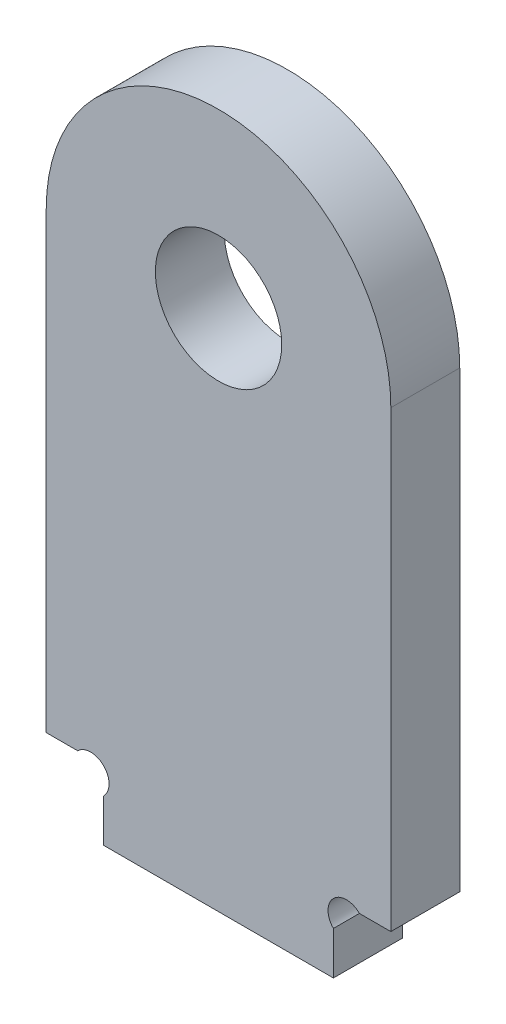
ISO-10303-21;
HEADER;
FILE_DESCRIPTION(('STEP AP214'),'2;1');
FILE_NAME('part.step','',(''),(''),'','','');
FILE_SCHEMA(('AUTOMOTIVE_DESIGN { 1 0 10303 214 1 1 1 1 }'));
ENDSEC;
DATA;
#1=APPLICATION_CONTEXT('core data for automotive mechanical design processes');
#2=APPLICATION_PROTOCOL_DEFINITION('international standard','automotive_design',2000,#1);
#3=PRODUCT_CONTEXT('',#1,'mechanical');
#4=PRODUCT('Part','Part','',(#3));
#5=PRODUCT_RELATED_PRODUCT_CATEGORY('part','',(#4));
#6=PRODUCT_DEFINITION_FORMATION('','',#4);
#7=PRODUCT_DEFINITION_CONTEXT('part definition',#1,'design');
#8=PRODUCT_DEFINITION('design','',#6,#7);
#9=PRODUCT_DEFINITION_SHAPE('','',#8);
#10=(LENGTH_UNIT() NAMED_UNIT(*) SI_UNIT(.MILLI.,.METRE.));
#11=(NAMED_UNIT(*) PLANE_ANGLE_UNIT() SI_UNIT($,.RADIAN.));
#12=(NAMED_UNIT(*) SI_UNIT($,.STERADIAN.) SOLID_ANGLE_UNIT());
#13=UNCERTAINTY_MEASURE_WITH_UNIT(LENGTH_MEASURE(1.E-05),#10,'distance_accuracy_value','');
#14=(GEOMETRIC_REPRESENTATION_CONTEXT(3) GLOBAL_UNCERTAINTY_ASSIGNED_CONTEXT((#13)) GLOBAL_UNIT_ASSIGNED_CONTEXT((#10,
#11,#12)) REPRESENTATION_CONTEXT('',''));
#15=CARTESIAN_POINT('',(0.,0.,0.));
#16=DIRECTION('',(0.,0.,1.));
#17=DIRECTION('',(1.,0.,0.));
#18=AXIS2_PLACEMENT_3D('',#15,#16,#17);
#19=CARTESIAN_POINT('',(15.,39.5,6.));
#20=DIRECTION('',(0.,0.,-1.));
#21=DIRECTION('',(-1.,0.,0.));
#22=AXIS2_PLACEMENT_3D('',#19,#20,#21);
#23=PLANE('',#22);
#24=CARTESIAN_POINT('',(15.,39.5,6.));
#25=DIRECTION('',(0.,0.,1.));
#26=DIRECTION('',(-1.,0.,0.));
#27=AXIS2_PLACEMENT_3D('',#24,#25,#26);
#28=CIRCLE('',#27,15.);
#29=CARTESIAN_POINT('',(30.,39.5,6.));
#30=VERTEX_POINT('',#29);
#31=CARTESIAN_POINT('',(0.,39.5,6.));
#32=VERTEX_POINT('',#31);
#33=EDGE_CURVE('E144',#30,#32,#28,.T.);
#34=ORIENTED_EDGE('',*,*,#33,.T.);
#35=DIRECTION('',(0.,-1.,0.));
#36=VECTOR('',#35,1.);
#37=CARTESIAN_POINT('',(0.,39.5,6.));
#38=LINE('',#37,#36);
#39=CARTESIAN_POINT('',(0.,0.,6.));
#40=VERTEX_POINT('',#39);
#41=EDGE_CURVE('E117',#32,#40,#38,.T.);
#42=ORIENTED_EDGE('',*,*,#41,.T.);
#43=DIRECTION('',(1.,0.,0.));
#44=VECTOR('',#43,1.);
#45=CARTESIAN_POINT('',(0.,0.,6.));
#46=LINE('',#45,#44);
#47=CARTESIAN_POINT('',(2.73725830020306,0.,6.));
#48=VERTEX_POINT('',#47);
#49=EDGE_CURVE('E147',#40,#48,#46,.T.);
#50=ORIENTED_EDGE('',*,*,#49,.T.);
#51=CARTESIAN_POINT('',(3.86862915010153,-1.13137084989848,6.));
#52=DIRECTION('',(0.,0.,-1.));
#53=DIRECTION('',(1.,0.,0.));
#54=AXIS2_PLACEMENT_3D('',#51,#52,#53);
#55=CIRCLE('',#54,1.6);
#56=CARTESIAN_POINT('',(5.,-2.26274169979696,6.));
#57=VERTEX_POINT('',#56);
#58=EDGE_CURVE('E149',#48,#57,#55,.T.);
#59=ORIENTED_EDGE('',*,*,#58,.T.);
#60=DIRECTION('',(0.,-1.,0.));
#61=VECTOR('',#60,1.);
#62=CARTESIAN_POINT('',(5.,-2.26274169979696,6.));
#63=LINE('',#62,#61);
#64=CARTESIAN_POINT('',(5.,-6.,6.));
#65=VERTEX_POINT('',#64);
#66=EDGE_CURVE('E151',#57,#65,#63,.T.);
#67=ORIENTED_EDGE('',*,*,#66,.T.);
#68=DIRECTION('',(1.,0.,0.));
#69=VECTOR('',#68,1.);
#70=CARTESIAN_POINT('',(5.,-6.,6.));
#71=LINE('',#70,#69);
#72=CARTESIAN_POINT('',(25.,-6.,6.));
#73=VERTEX_POINT('',#72);
#74=EDGE_CURVE('E153',#65,#73,#71,.T.);
#75=ORIENTED_EDGE('',*,*,#74,.T.);
#76=DIRECTION('',(0.,1.,0.));
#77=VECTOR('',#76,1.);
#78=CARTESIAN_POINT('',(25.,-6.,6.));
#79=LINE('',#78,#77);
#80=CARTESIAN_POINT('',(25.,-2.26274169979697,6.));
#81=VERTEX_POINT('',#80);
#82=EDGE_CURVE('E155',#73,#81,#79,.T.);
#83=ORIENTED_EDGE('',*,*,#82,.T.);
#84=CARTESIAN_POINT('',(26.1313708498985,-1.13137084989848,6.));
#85=DIRECTION('',(0.,0.,-1.));
#86=DIRECTION('',(-1.,0.,0.));
#87=AXIS2_PLACEMENT_3D('',#84,#85,#86);
#88=CIRCLE('',#87,1.6);
#89=CARTESIAN_POINT('',(27.262741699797,0.,6.));
#90=VERTEX_POINT('',#89);
#91=EDGE_CURVE('E157',#81,#90,#88,.T.);
#92=ORIENTED_EDGE('',*,*,#91,.T.);
#93=DIRECTION('',(1.,0.,0.));
#94=VECTOR('',#93,1.);
#95=CARTESIAN_POINT('',(27.262741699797,0.,6.));
#96=LINE('',#95,#94);
#97=CARTESIAN_POINT('',(30.,0.,6.));
#98=VERTEX_POINT('',#97);
#99=EDGE_CURVE('E46',#90,#98,#96,.T.);
#100=ORIENTED_EDGE('',*,*,#99,.T.);
#101=DIRECTION('',(0.,1.,0.));
#102=VECTOR('',#101,1.);
#103=CARTESIAN_POINT('',(30.,0.,6.));
#104=LINE('',#103,#102);
#105=EDGE_CURVE('E41',#98,#30,#104,.T.);
#106=ORIENTED_EDGE('',*,*,#105,.T.);
#107=EDGE_LOOP('',(#34,#42,#50,#59,#67,#75,#83,#92,#100,#106));
#108=FACE_BOUND('',#107,.T.);
#109=CARTESIAN_POINT('',(15.,39.5,6.));
#110=DIRECTION('',(0.,0.,1.));
#111=DIRECTION('',(1.,0.,0.));
#112=AXIS2_PLACEMENT_3D('',#109,#110,#111);
#113=CIRCLE('',#112,5.5);
#114=CARTESIAN_POINT('',(20.5,39.5,6.));
#115=VERTEX_POINT('',#114);
#116=EDGE_CURVE('E122',#115,#115,#113,.T.);
#117=ORIENTED_EDGE('',*,*,#116,.F.);
#118=EDGE_LOOP('',(#117));
#119=FACE_BOUND('',#118,.T.);
#120=ADVANCED_FACE('F26',(#108,#119),#23,.F.);
#121=CARTESIAN_POINT('',(15.,39.5,0.));
#122=DIRECTION('',(0.,0.,-1.));
#123=DIRECTION('',(-1.,0.,0.));
#124=AXIS2_PLACEMENT_3D('',#121,#122,#123);
#125=PLANE('',#124);
#126=CARTESIAN_POINT('',(15.,39.5,0.));
#127=DIRECTION('',(0.,0.,1.));
#128=DIRECTION('',(-1.,0.,0.));
#129=AXIS2_PLACEMENT_3D('',#126,#127,#128);
#130=CIRCLE('',#129,15.);
#131=CARTESIAN_POINT('',(30.,39.5,0.));
#132=VERTEX_POINT('',#131);
#133=CARTESIAN_POINT('',(0.,39.5,0.));
#134=VERTEX_POINT('',#133);
#135=EDGE_CURVE('E108',#132,#134,#130,.T.);
#136=ORIENTED_EDGE('',*,*,#135,.F.);
#137=DIRECTION('',(0.,1.,0.));
#138=VECTOR('',#137,1.);
#139=CARTESIAN_POINT('',(30.,0.,0.));
#140=LINE('',#139,#138);
#141=CARTESIAN_POINT('',(30.,0.,0.));
#142=VERTEX_POINT('',#141);
#143=EDGE_CURVE('E142',#142,#132,#140,.T.);
#144=ORIENTED_EDGE('',*,*,#143,.F.);
#145=DIRECTION('',(1.,0.,0.));
#146=VECTOR('',#145,1.);
#147=CARTESIAN_POINT('',(27.262741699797,0.,0.));
#148=LINE('',#147,#146);
#149=CARTESIAN_POINT('',(27.262741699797,0.,0.));
#150=VERTEX_POINT('',#149);
#151=EDGE_CURVE('E140',#150,#142,#148,.T.);
#152=ORIENTED_EDGE('',*,*,#151,.F.);
#153=CARTESIAN_POINT('',(26.1313708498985,-1.13137084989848,0.));
#154=DIRECTION('',(0.,0.,-1.));
#155=DIRECTION('',(-1.,0.,0.));
#156=AXIS2_PLACEMENT_3D('',#153,#154,#155);
#157=CIRCLE('',#156,1.6);
#158=CARTESIAN_POINT('',(25.,-2.26274169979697,0.));
#159=VERTEX_POINT('',#158);
#160=EDGE_CURVE('E138',#159,#150,#157,.T.);
#161=ORIENTED_EDGE('',*,*,#160,.F.);
#162=DIRECTION('',(0.,1.,0.));
#163=VECTOR('',#162,1.);
#164=CARTESIAN_POINT('',(25.,-6.,0.));
#165=LINE('',#164,#163);
#166=CARTESIAN_POINT('',(25.,-6.,0.));
#167=VERTEX_POINT('',#166);
#168=EDGE_CURVE('E136',#167,#159,#165,.T.);
#169=ORIENTED_EDGE('',*,*,#168,.F.);
#170=DIRECTION('',(1.,0.,0.));
#171=VECTOR('',#170,1.);
#172=CARTESIAN_POINT('',(5.,-6.,0.));
#173=LINE('',#172,#171);
#174=CARTESIAN_POINT('',(5.,-6.,0.));
#175=VERTEX_POINT('',#174);
#176=EDGE_CURVE('E134',#175,#167,#173,.T.);
#177=ORIENTED_EDGE('',*,*,#176,.F.);
#178=DIRECTION('',(0.,-1.,0.));
#179=VECTOR('',#178,1.);
#180=CARTESIAN_POINT('',(5.,-2.26274169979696,0.));
#181=LINE('',#180,#179);
#182=CARTESIAN_POINT('',(5.,-2.26274169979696,0.));
#183=VERTEX_POINT('',#182);
#184=EDGE_CURVE('E132',#183,#175,#181,.T.);
#185=ORIENTED_EDGE('',*,*,#184,.F.);
#186=CARTESIAN_POINT('',(3.86862915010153,-1.13137084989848,0.));
#187=DIRECTION('',(0.,0.,-1.));
#188=DIRECTION('',(1.,0.,0.));
#189=AXIS2_PLACEMENT_3D('',#186,#187,#188);
#190=CIRCLE('',#189,1.6);
#191=CARTESIAN_POINT('',(2.73725830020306,0.,0.));
#192=VERTEX_POINT('',#191);
#193=EDGE_CURVE('E130',#192,#183,#190,.T.);
#194=ORIENTED_EDGE('',*,*,#193,.F.);
#195=DIRECTION('',(1.,0.,0.));
#196=VECTOR('',#195,1.);
#197=CARTESIAN_POINT('',(0.,0.,0.));
#198=LINE('',#197,#196);
#199=CARTESIAN_POINT('',(0.,0.,0.));
#200=VERTEX_POINT('',#199);
#201=EDGE_CURVE('E110',#200,#192,#198,.T.);
#202=ORIENTED_EDGE('',*,*,#201,.F.);
#203=DIRECTION('',(0.,-1.,0.));
#204=VECTOR('',#203,1.);
#205=CARTESIAN_POINT('',(0.,39.5,0.));
#206=LINE('',#205,#204);
#207=EDGE_CURVE('E103',#134,#200,#206,.T.);
#208=ORIENTED_EDGE('',*,*,#207,.F.);
#209=EDGE_LOOP('',(#136,#144,#152,#161,#169,#177,#185,#194,#202,#208));
#210=FACE_BOUND('',#209,.T.);
#211=CARTESIAN_POINT('',(15.,39.5,0.));
#212=DIRECTION('',(0.,0.,1.));
#213=DIRECTION('',(1.,0.,0.));
#214=AXIS2_PLACEMENT_3D('',#211,#212,#213);
#215=CIRCLE('',#214,5.5);
#216=CARTESIAN_POINT('',(20.5,39.5,0.));
#217=VERTEX_POINT('',#216);
#218=EDGE_CURVE('E125',#217,#217,#215,.T.);
#219=ORIENTED_EDGE('',*,*,#218,.T.);
#220=EDGE_LOOP('',(#219));
#221=FACE_BOUND('',#220,.T.);
#222=ADVANCED_FACE('F104',(#210,#221),#125,.T.);
#223=CARTESIAN_POINT('',(15.,39.5,6.));
#224=DIRECTION('',(0.,0.,-1.));
#225=DIRECTION('',(-1.,0.,0.));
#226=AXIS2_PLACEMENT_3D('',#223,#224,#225);
#227=CYLINDRICAL_SURFACE('',#226,15.);
#228=ORIENTED_EDGE('',*,*,#135,.T.);
#229=DIRECTION('',(0.,0.,-1.));
#230=VECTOR('',#229,1.);
#231=CARTESIAN_POINT('',(0.,39.5,6.));
#232=LINE('',#231,#230);
#233=EDGE_CURVE('E11',#32,#134,#232,.T.);
#234=ORIENTED_EDGE('',*,*,#233,.F.);
#235=ORIENTED_EDGE('',*,*,#33,.F.);
#236=DIRECTION('',(0.,0.,-1.));
#237=VECTOR('',#236,1.);
#238=CARTESIAN_POINT('',(30.,39.5,6.));
#239=LINE('',#238,#237);
#240=EDGE_CURVE('E121',#30,#132,#239,.T.);
#241=ORIENTED_EDGE('',*,*,#240,.T.);
#242=EDGE_LOOP('',(#228,#234,#235,#241));
#243=FACE_BOUND('',#242,.T.);
#244=ADVANCED_FACE('F28',(#243),#227,.T.);
#245=CARTESIAN_POINT('',(0.,39.5,6.));
#246=DIRECTION('',(1.,0.,0.));
#247=DIRECTION('',(0.,0.,-1.));
#248=AXIS2_PLACEMENT_3D('',#245,#246,#247);
#249=PLANE('',#248);
#250=ORIENTED_EDGE('',*,*,#207,.T.);
#251=DIRECTION('',(0.,0.,-1.));
#252=VECTOR('',#251,1.);
#253=CARTESIAN_POINT('',(0.,0.,6.));
#254=LINE('',#253,#252);
#255=EDGE_CURVE('E34',#40,#200,#254,.T.);
#256=ORIENTED_EDGE('',*,*,#255,.F.);
#257=ORIENTED_EDGE('',*,*,#41,.F.);
#258=ORIENTED_EDGE('',*,*,#233,.T.);
#259=EDGE_LOOP('',(#250,#256,#257,#258));
#260=FACE_BOUND('',#259,.T.);
#261=ADVANCED_FACE('F116',(#260),#249,.F.);
#262=CARTESIAN_POINT('',(0.,0.,6.));
#263=DIRECTION('',(0.,1.,0.));
#264=DIRECTION('',(0.,0.,1.));
#265=AXIS2_PLACEMENT_3D('',#262,#263,#264);
#266=PLANE('',#265);
#267=ORIENTED_EDGE('',*,*,#201,.T.);
#268=DIRECTION('',(0.,0.,-1.));
#269=VECTOR('',#268,1.);
#270=CARTESIAN_POINT('',(2.73725830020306,0.,6.));
#271=LINE('',#270,#269);
#272=EDGE_CURVE('E180',#48,#192,#271,.T.);
#273=ORIENTED_EDGE('',*,*,#272,.F.);
#274=ORIENTED_EDGE('',*,*,#49,.F.);
#275=ORIENTED_EDGE('',*,*,#255,.T.);
#276=EDGE_LOOP('',(#267,#273,#274,#275));
#277=FACE_BOUND('',#276,.T.);
#278=ADVANCED_FACE('F184',(#277),#266,.F.);
#279=CARTESIAN_POINT('',(3.86862915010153,-1.13137084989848,6.));
#280=DIRECTION('',(0.,0.,-1.));
#281=DIRECTION('',(-1.,0.,0.));
#282=AXIS2_PLACEMENT_3D('',#279,#280,#281);
#283=CYLINDRICAL_SURFACE('',#282,1.6);
#284=ORIENTED_EDGE('',*,*,#193,.T.);
#285=DIRECTION('',(0.,0.,-1.));
#286=VECTOR('',#285,1.);
#287=CARTESIAN_POINT('',(5.,-2.26274169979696,6.));
#288=LINE('',#287,#286);
#289=EDGE_CURVE('E177',#57,#183,#288,.T.);
#290=ORIENTED_EDGE('',*,*,#289,.F.);
#291=ORIENTED_EDGE('',*,*,#58,.F.);
#292=ORIENTED_EDGE('',*,*,#272,.T.);
#293=EDGE_LOOP('',(#284,#290,#291,#292));
#294=FACE_BOUND('',#293,.T.);
#295=ADVANCED_FACE('F192',(#294),#283,.F.);
#296=CARTESIAN_POINT('',(5.,-2.26274169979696,6.));
#297=DIRECTION('',(1.,0.,0.));
#298=DIRECTION('',(0.,1.,0.));
#299=AXIS2_PLACEMENT_3D('',#296,#297,#298);
#300=PLANE('',#299);
#301=ORIENTED_EDGE('',*,*,#184,.T.);
#302=DIRECTION('',(0.,0.,-1.));
#303=VECTOR('',#302,1.);
#304=CARTESIAN_POINT('',(5.,-6.,6.));
#305=LINE('',#304,#303);
#306=EDGE_CURVE('E174',#65,#175,#305,.T.);
#307=ORIENTED_EDGE('',*,*,#306,.F.);
#308=ORIENTED_EDGE('',*,*,#66,.F.);
#309=ORIENTED_EDGE('',*,*,#289,.T.);
#310=EDGE_LOOP('',(#301,#307,#308,#309));
#311=FACE_BOUND('',#310,.T.);
#312=ADVANCED_FACE('F195',(#311),#300,.F.);
#313=CARTESIAN_POINT('',(5.,-6.,6.));
#314=DIRECTION('',(0.,1.,0.));
#315=DIRECTION('',(0.,0.,1.));
#316=AXIS2_PLACEMENT_3D('',#313,#314,#315);
#317=PLANE('',#316);
#318=ORIENTED_EDGE('',*,*,#176,.T.);
#319=DIRECTION('',(0.,0.,-1.));
#320=VECTOR('',#319,1.);
#321=CARTESIAN_POINT('',(25.,-6.,6.));
#322=LINE('',#321,#320);
#323=EDGE_CURVE('E171',#73,#167,#322,.T.);
#324=ORIENTED_EDGE('',*,*,#323,.F.);
#325=ORIENTED_EDGE('',*,*,#74,.F.);
#326=ORIENTED_EDGE('',*,*,#306,.T.);
#327=EDGE_LOOP('',(#318,#324,#325,#326));
#328=FACE_BOUND('',#327,.T.);
#329=ADVANCED_FACE('F200',(#328),#317,.F.);
#330=CARTESIAN_POINT('',(25.,-6.,6.));
#331=DIRECTION('',(-1.,0.,0.));
#332=DIRECTION('',(0.,0.,1.));
#333=AXIS2_PLACEMENT_3D('',#330,#331,#332);
#334=PLANE('',#333);
#335=ORIENTED_EDGE('',*,*,#168,.T.);
#336=DIRECTION('',(0.,0.,-1.));
#337=VECTOR('',#336,1.);
#338=CARTESIAN_POINT('',(25.,-2.26274169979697,6.));
#339=LINE('',#338,#337);
#340=EDGE_CURVE('E168',#81,#159,#339,.T.);
#341=ORIENTED_EDGE('',*,*,#340,.F.);
#342=ORIENTED_EDGE('',*,*,#82,.F.);
#343=ORIENTED_EDGE('',*,*,#323,.T.);
#344=EDGE_LOOP('',(#335,#341,#342,#343));
#345=FACE_BOUND('',#344,.T.);
#346=ADVANCED_FACE('F206',(#345),#334,.F.);
#347=CARTESIAN_POINT('',(26.1313708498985,-1.13137084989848,6.));
#348=DIRECTION('',(0.,0.,-1.));
#349=DIRECTION('',(-1.,0.,0.));
#350=AXIS2_PLACEMENT_3D('',#347,#348,#349);
#351=CYLINDRICAL_SURFACE('',#350,1.6);
#352=ORIENTED_EDGE('',*,*,#160,.T.);
#353=DIRECTION('',(0.,0.,-1.));
#354=VECTOR('',#353,1.);
#355=CARTESIAN_POINT('',(27.262741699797,0.,6.));
#356=LINE('',#355,#354);
#357=EDGE_CURVE('E165',#90,#150,#356,.T.);
#358=ORIENTED_EDGE('',*,*,#357,.F.);
#359=ORIENTED_EDGE('',*,*,#91,.F.);
#360=ORIENTED_EDGE('',*,*,#340,.T.);
#361=EDGE_LOOP('',(#352,#358,#359,#360));
#362=FACE_BOUND('',#361,.T.);
#363=ADVANCED_FACE('F210',(#362),#351,.F.);
#364=CARTESIAN_POINT('',(27.262741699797,0.,6.));
#365=DIRECTION('',(0.,1.,0.));
#366=DIRECTION('',(-1.,0.,0.));
#367=AXIS2_PLACEMENT_3D('',#364,#365,#366);
#368=PLANE('',#367);
#369=ORIENTED_EDGE('',*,*,#151,.T.);
#370=DIRECTION('',(0.,0.,-1.));
#371=VECTOR('',#370,1.);
#372=CARTESIAN_POINT('',(30.,0.,6.));
#373=LINE('',#372,#371);
#374=EDGE_CURVE('E162',#98,#142,#373,.T.);
#375=ORIENTED_EDGE('',*,*,#374,.F.);
#376=ORIENTED_EDGE('',*,*,#99,.F.);
#377=ORIENTED_EDGE('',*,*,#357,.T.);
#378=EDGE_LOOP('',(#369,#375,#376,#377));
#379=FACE_BOUND('',#378,.T.);
#380=ADVANCED_FACE('F213',(#379),#368,.F.);
#381=CARTESIAN_POINT('',(30.,0.,6.));
#382=DIRECTION('',(-1.,0.,0.));
#383=DIRECTION('',(0.,-1.,0.));
#384=AXIS2_PLACEMENT_3D('',#381,#382,#383);
#385=PLANE('',#384);
#386=ORIENTED_EDGE('',*,*,#143,.T.);
#387=ORIENTED_EDGE('',*,*,#240,.F.);
#388=ORIENTED_EDGE('',*,*,#105,.F.);
#389=ORIENTED_EDGE('',*,*,#374,.T.);
#390=EDGE_LOOP('',(#386,#387,#388,#389));
#391=FACE_BOUND('',#390,.T.);
#392=ADVANCED_FACE('F215',(#391),#385,.F.);
#393=CARTESIAN_POINT('',(15.,39.5,6.));
#394=DIRECTION('',(0.,0.,-1.));
#395=DIRECTION('',(-1.,0.,0.));
#396=AXIS2_PLACEMENT_3D('',#393,#394,#395);
#397=CYLINDRICAL_SURFACE('',#396,5.5);
#398=ORIENTED_EDGE('',*,*,#116,.T.);
#399=EDGE_LOOP('',(#398));
#400=FACE_BOUND('',#399,.T.);
#401=ORIENTED_EDGE('',*,*,#218,.F.);
#402=EDGE_LOOP('',(#401));
#403=FACE_BOUND('',#402,.T.);
#404=ADVANCED_FACE('F217',(#400,#403),#397,.F.);
#405=CLOSED_SHELL('',(#120,#222,#244,#261,#278,#295,#312,#329,#346,#363,#380,#392,#404));
#406=MANIFOLD_SOLID_BREP('B2',#405);
#407=ADVANCED_BREP_SHAPE_REPRESENTATION('',(#18,#406),#14);
#408=SHAPE_DEFINITION_REPRESENTATION(#9,#407);
ENDSEC;
END-ISO-10303-21;
